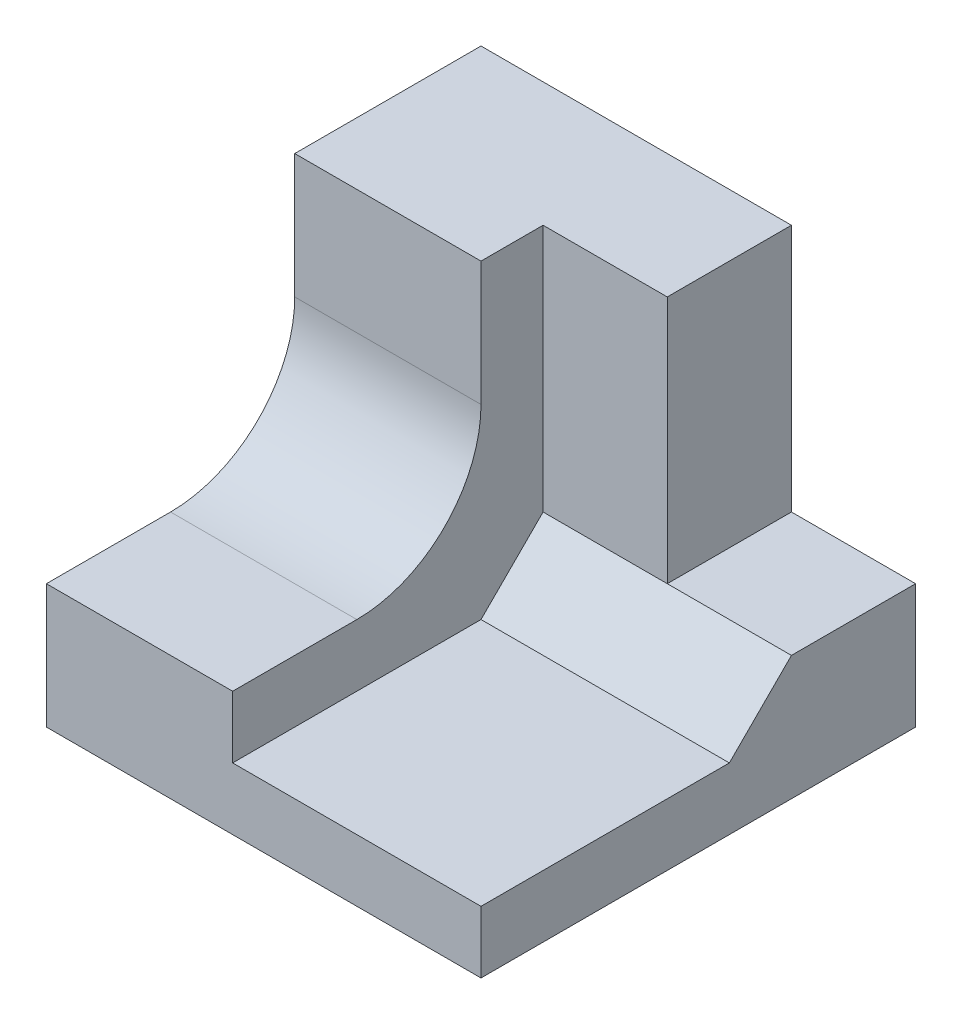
from build123d import *

# Parameters (mm, degrees)
SKETCH_1_W          = 70
SKETCH_1_H          = 70
EXTRUDE_1_DEPTH     = 60
SKETCH_2_W          = 40
SKETCH_2_H          = 50
CUT_EXTRUDE_1_DEPTH = 50
SKETCH_3_W          = 40
SKETCH_3_H          = 40
CUT_EXTRUDE_2_DEPTH = 101.498756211
SKETCH_4_W          = 20
SKETCH_4_H          = 40
CUT_EXTRUDE_3_DEPTH = 105.880884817
CHAMFER_1_SIZE      = 10
FILLET_1_R          = 20


with BuildPart() as part:
    # Sketch 1 → Extrude 1 (new body)
    with BuildSketch(Plane(origin=(0, 0, 0), x_dir=(1, 0, 0), z_dir=(0, 1, 0))):
        with Locations((35, 35)):
            Rectangle(SKETCH_1_W, SKETCH_1_H)
    extrude(amount=EXTRUDE_1_DEPTH)

    # Sketch 2 → Cut-Extrude 1 (cut)
    with BuildSketch(Plane(origin=(0, 60, 0), x_dir=(1, 0, 0), z_dir=(0, 1, 0))):
        with Locations((50, 25)):
            Rectangle(SKETCH_2_W, SKETCH_2_H)
    extrude(amount=-CUT_EXTRUDE_1_DEPTH, mode=Mode.SUBTRACT)

    # Sketch 3 → Cut-Extrude 2 (cut, through all)
    with BuildSketch(Plane(origin=(30, 0, 0), x_dir=(0, 0, -1), z_dir=(1, 0, 0))):
        with Locations((20, 40)):
            Rectangle(SKETCH_3_W, SKETCH_3_H)
    extrude(amount=-CUT_EXTRUDE_2_DEPTH, mode=Mode.SUBTRACT)

    # Sketch 4 → Cut-Extrude 3 (cut, through all)
    with BuildSketch(Plane.XY.offset(-50)):
        with Locations((60, 40)):
            Rectangle(SKETCH_4_W, SKETCH_4_H)
    extrude(amount=-CUT_EXTRUDE_3_DEPTH, mode=Mode.SUBTRACT)

    # Chamfer 1
    chamfer_1_edges = [part.edges().sort_by_distance(p)[0] for p in [
        (50, 10, -50),
    ]]
    chamfer(chamfer_1_edges, length=CHAMFER_1_SIZE)

    # Fillet 1
    fillet_1_edges = [part.edges().sort_by_distance(p)[0] for p in [
        (15, 20, -40),
    ]]
    fillet(fillet_1_edges, radius=FILLET_1_R)


solid = part.part
